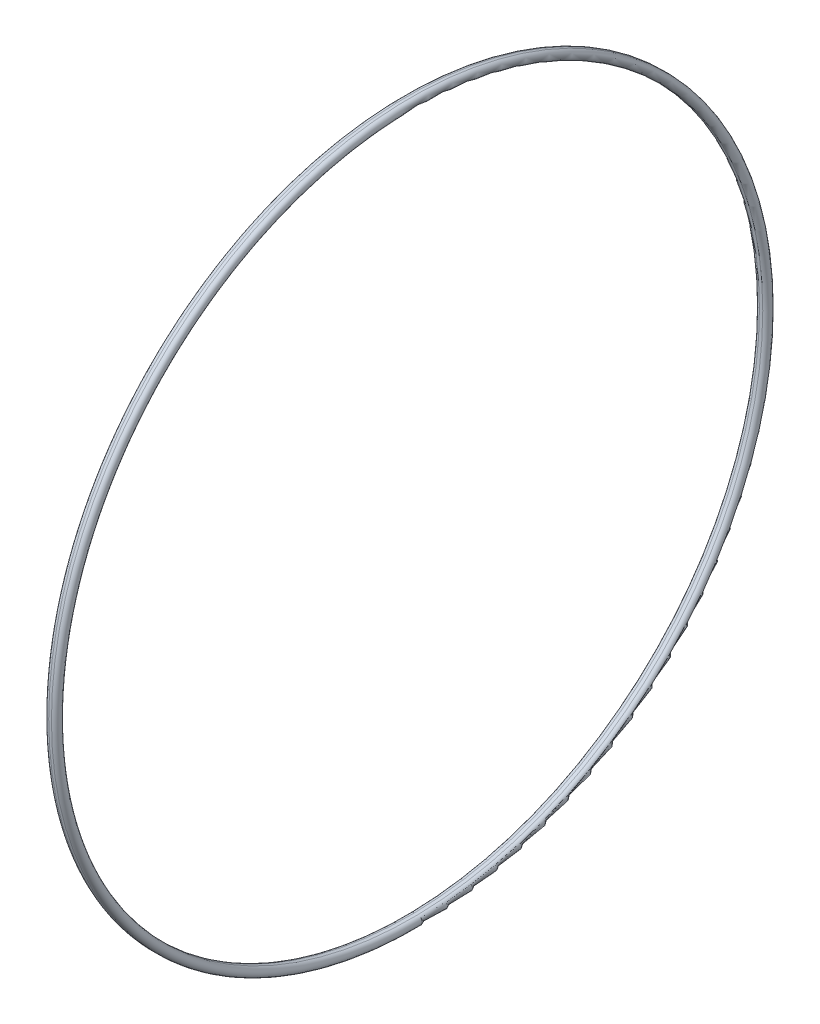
from build123d import *


with BuildPart() as part:
    # Sketch1 → Revolve1 (revolve)
    with BuildSketch(Plane.XY, mode=Mode.PRIVATE) as revolve1_sk:
        with BuildLine():
            Line((-1.041376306, 219.6719), (1.041376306, 219.6719))
            ThreePointArc((1.041376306, 219.6719), (3.524219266, 222.707622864), (0.660376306, 225.3869))
            Line((0.660376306, 225.3869), (-1.041376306, 225.3869))
            ThreePointArc((-1.041376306, 225.3869), (-3.898876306, 222.5294), (-1.041376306, 219.6719))
        make_face()
    revolve(revolve1_sk.sketch.rotate(Axis((0, 0, 0), (-1, 0, 0)), 90), axis=Axis((0, 0, 0), (-1, 0, 0)))


solid = part.part
